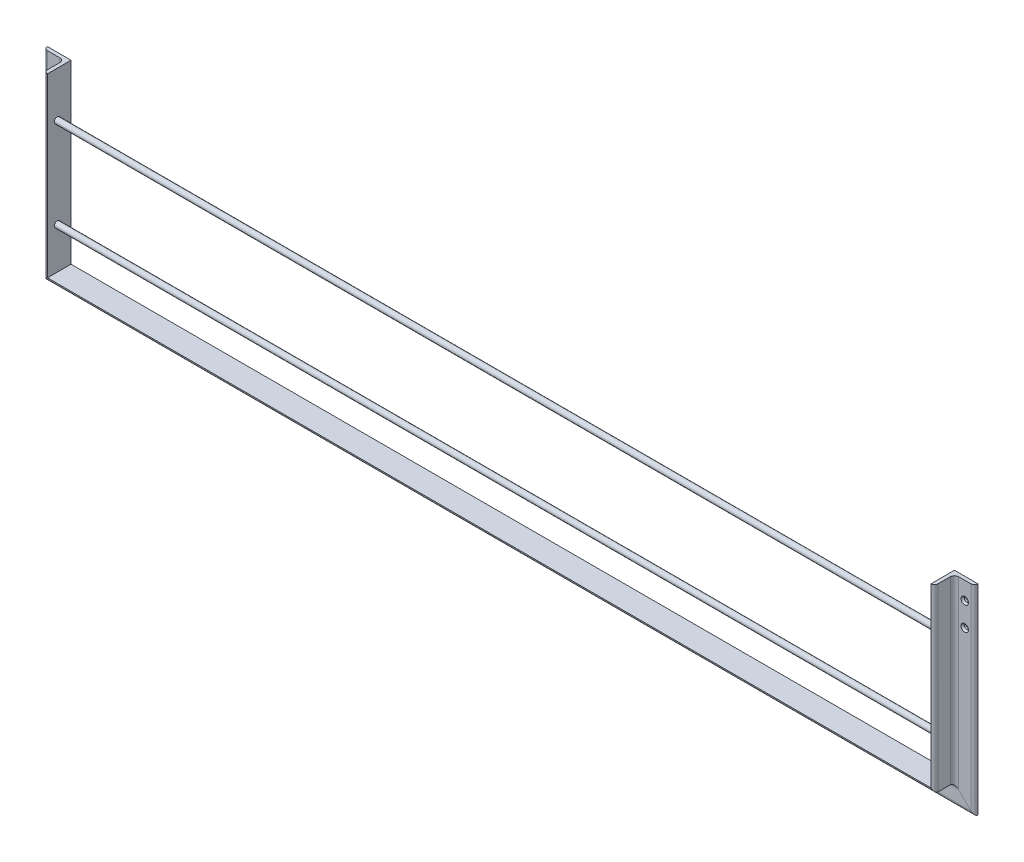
ISO-10303-21;
HEADER;
FILE_DESCRIPTION(('STEP AP214'),'2;1');
FILE_NAME('part.step','',(''),(''),'','','');
FILE_SCHEMA(('AUTOMOTIVE_DESIGN { 1 0 10303 214 1 1 1 1 }'));
ENDSEC;
DATA;
#1=APPLICATION_CONTEXT('core data for automotive mechanical design processes');
#2=APPLICATION_PROTOCOL_DEFINITION('international standard','automotive_design',2000,#1);
#3=PRODUCT_CONTEXT('',#1,'mechanical');
#4=PRODUCT('Part','Part','',(#3));
#5=PRODUCT_RELATED_PRODUCT_CATEGORY('part','',(#4));
#6=PRODUCT_DEFINITION_FORMATION('','',#4);
#7=PRODUCT_DEFINITION_CONTEXT('part definition',#1,'design');
#8=PRODUCT_DEFINITION('design','',#6,#7);
#9=PRODUCT_DEFINITION_SHAPE('','',#8);
#10=(LENGTH_UNIT() NAMED_UNIT(*) SI_UNIT(.MILLI.,.METRE.));
#11=(NAMED_UNIT(*) PLANE_ANGLE_UNIT() SI_UNIT($,.RADIAN.));
#12=(NAMED_UNIT(*) SI_UNIT($,.STERADIAN.) SOLID_ANGLE_UNIT());
#13=UNCERTAINTY_MEASURE_WITH_UNIT(LENGTH_MEASURE(1.E-05),#10,'distance_accuracy_value','');
#14=(GEOMETRIC_REPRESENTATION_CONTEXT(3) GLOBAL_UNCERTAINTY_ASSIGNED_CONTEXT((#13)) GLOBAL_UNIT_ASSIGNED_CONTEXT((#10,
#11,#12)) REPRESENTATION_CONTEXT('',''));
#15=CARTESIAN_POINT('',(0.,0.,0.));
#16=DIRECTION('',(0.,0.,1.));
#17=DIRECTION('',(1.,0.,0.));
#18=AXIS2_PLACEMENT_3D('',#15,#16,#17);
#19=CARTESIAN_POINT('',(750.,0.,0.));
#20=DIRECTION('',(1.,0.,0.));
#21=DIRECTION('',(0.,0.,-1.));
#22=AXIS2_PLACEMENT_3D('',#19,#20,#21);
#23=PLANE('',#22);
#24=CARTESIAN_POINT('',(750.,35.25,11.75));
#25=DIRECTION('',(1.,0.,0.));
#26=DIRECTION('',(0.,0.,-1.));
#27=AXIS2_PLACEMENT_3D('',#24,#25,#26);
#28=CIRCLE('',#27,2.5);
#29=CARTESIAN_POINT('',(750.,35.25,14.25));
#30=VERTEX_POINT('',#29);
#31=EDGE_CURVE('E11',#30,#30,#28,.T.);
#32=ORIENTED_EDGE('',*,*,#31,.T.);
#33=EDGE_LOOP('',(#32));
#34=FACE_BOUND('',#33,.T.);
#35=ADVANCED_FACE('F50',(#34),#23,.T.);
#36=CARTESIAN_POINT('',(0.,35.25,11.75));
#37=DIRECTION('',(1.,0.,0.));
#38=DIRECTION('',(0.,0.,-1.));
#39=AXIS2_PLACEMENT_3D('',#36,#37,#38);
#40=PLANE('',#39);
#41=CARTESIAN_POINT('',(0.,35.25,11.75));
#42=DIRECTION('',(1.,0.,0.));
#43=DIRECTION('',(0.,0.,-1.));
#44=AXIS2_PLACEMENT_3D('',#41,#42,#43);
#45=CIRCLE('',#44,2.5);
#46=CARTESIAN_POINT('',(0.,35.25,14.25));
#47=VERTEX_POINT('',#46);
#48=EDGE_CURVE('E57',#47,#47,#45,.T.);
#49=ORIENTED_EDGE('',*,*,#48,.F.);
#50=EDGE_LOOP('',(#49));
#51=FACE_BOUND('',#50,.T.);
#52=ADVANCED_FACE('F65',(#51),#40,.F.);
#53=CARTESIAN_POINT('',(500000.,35.25,11.75));
#54=DIRECTION('',(-1.,0.,0.));
#55=DIRECTION('',(0.,0.,1.));
#56=AXIS2_PLACEMENT_3D('',#53,#54,#55);
#57=CYLINDRICAL_SURFACE('',#56,2.5);
#58=CARTESIAN_POINT('',(0.,35.25,14.25));
#59=CARTESIAN_POINT('',(7.8125,35.25,14.25));
#60=CARTESIAN_POINT('',(15.625,35.25,14.25));
#61=CARTESIAN_POINT('',(31.25,35.25,14.25));
#62=CARTESIAN_POINT('',(39.0625,35.25,14.25));
#63=CARTESIAN_POINT('',(54.6875,35.25,14.25));
#64=CARTESIAN_POINT('',(62.5,35.25,14.25));
#65=CARTESIAN_POINT('',(78.125,35.25,14.25));
#66=CARTESIAN_POINT('',(85.9375,35.25,14.25));
#67=CARTESIAN_POINT('',(101.5625,35.25,14.25));
#68=CARTESIAN_POINT('',(109.375,35.25,14.25));
#69=CARTESIAN_POINT('',(125.,35.25,14.25));
#70=CARTESIAN_POINT('',(132.8125,35.25,14.25));
#71=CARTESIAN_POINT('',(148.4375,35.25,14.25));
#72=CARTESIAN_POINT('',(156.25,35.25,14.25));
#73=CARTESIAN_POINT('',(171.875,35.25,14.25));
#74=CARTESIAN_POINT('',(179.6875,35.25,14.25));
#75=CARTESIAN_POINT('',(195.3125,35.25,14.25));
#76=CARTESIAN_POINT('',(203.125,35.25,14.25));
#77=CARTESIAN_POINT('',(218.75,35.25,14.25));
#78=CARTESIAN_POINT('',(226.5625,35.25,14.25));
#79=CARTESIAN_POINT('',(242.1875,35.25,14.25));
#80=CARTESIAN_POINT('',(250.,35.25,14.25));
#81=CARTESIAN_POINT('',(265.625,35.25,14.25));
#82=CARTESIAN_POINT('',(273.4375,35.25,14.25));
#83=CARTESIAN_POINT('',(289.0625,35.25,14.25));
#84=CARTESIAN_POINT('',(296.875,35.25,14.25));
#85=CARTESIAN_POINT('',(312.5,35.25,14.25));
#86=CARTESIAN_POINT('',(320.3125,35.25,14.25));
#87=CARTESIAN_POINT('',(335.9375,35.25,14.25));
#88=CARTESIAN_POINT('',(343.75,35.25,14.25));
#89=CARTESIAN_POINT('',(359.375,35.25,14.25));
#90=CARTESIAN_POINT('',(367.1875,35.25,14.25));
#91=CARTESIAN_POINT('',(382.8125,35.25,14.25));
#92=CARTESIAN_POINT('',(390.625,35.25,14.25));
#93=CARTESIAN_POINT('',(406.25,35.25,14.25));
#94=CARTESIAN_POINT('',(414.0625,35.25,14.25));
#95=CARTESIAN_POINT('',(429.6875,35.25,14.25));
#96=CARTESIAN_POINT('',(437.5,35.25,14.25));
#97=CARTESIAN_POINT('',(453.125,35.25,14.25));
#98=CARTESIAN_POINT('',(460.9375,35.25,14.25));
#99=CARTESIAN_POINT('',(476.5625,35.25,14.25));
#100=CARTESIAN_POINT('',(484.375,35.25,14.25));
#101=CARTESIAN_POINT('',(500.,35.25,14.25));
#102=CARTESIAN_POINT('',(507.8125,35.25,14.25));
#103=CARTESIAN_POINT('',(523.4375,35.25,14.25));
#104=CARTESIAN_POINT('',(531.25,35.25,14.25));
#105=CARTESIAN_POINT('',(546.875,35.25,14.25));
#106=CARTESIAN_POINT('',(554.6875,35.25,14.25));
#107=CARTESIAN_POINT('',(570.3125,35.25,14.25));
#108=CARTESIAN_POINT('',(578.125,35.25,14.25));
#109=CARTESIAN_POINT('',(593.75,35.25,14.25));
#110=CARTESIAN_POINT('',(601.5625,35.25,14.25));
#111=CARTESIAN_POINT('',(617.1875,35.25,14.25));
#112=CARTESIAN_POINT('',(625.,35.25,14.25));
#113=CARTESIAN_POINT('',(640.625,35.25,14.25));
#114=CARTESIAN_POINT('',(648.4375,35.25,14.25));
#115=CARTESIAN_POINT('',(664.0625,35.25,14.25));
#116=CARTESIAN_POINT('',(671.875,35.25,14.25));
#117=CARTESIAN_POINT('',(687.5,35.25,14.25));
#118=CARTESIAN_POINT('',(695.3125,35.25,14.25));
#119=CARTESIAN_POINT('',(710.9375,35.25,14.25));
#120=CARTESIAN_POINT('',(718.75,35.25,14.25));
#121=CARTESIAN_POINT('',(734.375,35.25,14.25));
#122=CARTESIAN_POINT('',(742.1875,35.25,14.25));
#123=CARTESIAN_POINT('',(750.,35.25,14.25));
#124=B_SPLINE_CURVE_WITH_KNOTS('',3,(#58,#59,#60,#61,#62,#63,#64,#65,#66,#67,#68,#69,#70,#71,
#72,#73,#74,#75,#76,#77,#78,#79,#80,#81,#82,#83,#84,#85,#86,#87,#88,#89,#90,#91,#92,#93,#94,#95,
#96,#97,#98,#99,#100,#101,#102,#103,#104,#105,#106,#107,#108,#109,#110,#111,#112,#113,#114,#115,
#116,#117,#118,#119,#120,#121,#122,#123),.UNSPECIFIED.,.F.,.F.,(4,2,2,2,2,2,2,2,2,2,2,2,2,2,2,2,
2,2,2,2,2,2,2,2,2,2,2,2,2,2,2,2,4),(0.,23.4375,46.875,70.3125,93.75,117.1875,140.625,164.0625,
187.5,210.9375,234.375,257.8125,281.25,304.6875,328.125,351.5625,375.,398.4375,421.875,445.3125,
468.75,492.1875,515.625,539.0625,562.5,585.9375,609.375,632.8125,656.25,679.6875,703.125,
726.5625,750.),.UNSPECIFIED.);
#125=EDGE_CURVE('BSEAM52',#47,#30,#124,.T.);
#126=ORIENTED_EDGE('',*,*,#48,.T.);
#127=ORIENTED_EDGE('',*,*,#31,.F.);
#128=ORIENTED_EDGE('',*,*,#125,.T.);
#129=ORIENTED_EDGE('',*,*,#125,.F.);
#130=EDGE_LOOP('',(#126,#128,#127,#129));
#131=FACE_BOUND('',#130,.T.);
#132=ADVANCED_FACE('F52',(#131),#57,.T.);
#133=CLOSED_SHELL('',(#35,#52,#132));
#134=MANIFOLD_SOLID_BREP('B2',#133);
#135=CARTESIAN_POINT('',(750.,0.,0.));
#136=DIRECTION('',(1.,0.,0.));
#137=DIRECTION('',(0.,0.,-1.));
#138=AXIS2_PLACEMENT_3D('',#135,#136,#137);
#139=PLANE('',#138);
#140=CARTESIAN_POINT('',(750.,111.75,11.75));
#141=DIRECTION('',(1.,0.,0.));
#142=DIRECTION('',(0.,0.,-1.));
#143=AXIS2_PLACEMENT_3D('',#140,#141,#142);
#144=CIRCLE('',#143,2.5);
#145=CARTESIAN_POINT('',(750.,111.75,14.25));
#146=VERTEX_POINT('',#145);
#147=EDGE_CURVE('E49',#146,#146,#144,.T.);
#148=ORIENTED_EDGE('',*,*,#147,.T.);
#149=EDGE_LOOP('',(#148));
#150=FACE_BOUND('',#149,.T.);
#151=ADVANCED_FACE('F103',(#150),#139,.T.);
#152=CARTESIAN_POINT('',(0.,111.75,11.75));
#153=DIRECTION('',(1.,0.,0.));
#154=DIRECTION('',(0.,0.,-1.));
#155=AXIS2_PLACEMENT_3D('',#152,#153,#154);
#156=PLANE('',#155);
#157=CARTESIAN_POINT('',(0.,111.75,11.75));
#158=DIRECTION('',(1.,0.,0.));
#159=DIRECTION('',(0.,0.,-1.));
#160=AXIS2_PLACEMENT_3D('',#157,#158,#159);
#161=CIRCLE('',#160,2.5);
#162=CARTESIAN_POINT('',(0.,111.75,14.25));
#163=VERTEX_POINT('',#162);
#164=EDGE_CURVE('E110',#163,#163,#161,.T.);
#165=ORIENTED_EDGE('',*,*,#164,.F.);
#166=EDGE_LOOP('',(#165));
#167=FACE_BOUND('',#166,.T.);
#168=ADVANCED_FACE('F118',(#167),#156,.F.);
#169=CARTESIAN_POINT('',(500000.,111.75,11.75));
#170=DIRECTION('',(-1.,0.,0.));
#171=DIRECTION('',(0.,0.,1.));
#172=AXIS2_PLACEMENT_3D('',#169,#170,#171);
#173=CYLINDRICAL_SURFACE('',#172,2.5);
#174=CARTESIAN_POINT('',(0.,111.75,14.25));
#175=CARTESIAN_POINT('',(7.8125,111.75,14.25));
#176=CARTESIAN_POINT('',(15.625,111.75,14.25));
#177=CARTESIAN_POINT('',(31.25,111.75,14.25));
#178=CARTESIAN_POINT('',(39.0625,111.75,14.25));
#179=CARTESIAN_POINT('',(54.6875,111.75,14.25));
#180=CARTESIAN_POINT('',(62.5,111.75,14.25));
#181=CARTESIAN_POINT('',(78.125,111.75,14.25));
#182=CARTESIAN_POINT('',(85.9375,111.75,14.25));
#183=CARTESIAN_POINT('',(101.5625,111.75,14.25));
#184=CARTESIAN_POINT('',(109.375,111.75,14.25));
#185=CARTESIAN_POINT('',(125.,111.75,14.25));
#186=CARTESIAN_POINT('',(132.8125,111.75,14.25));
#187=CARTESIAN_POINT('',(148.4375,111.75,14.25));
#188=CARTESIAN_POINT('',(156.25,111.75,14.25));
#189=CARTESIAN_POINT('',(171.875,111.75,14.25));
#190=CARTESIAN_POINT('',(179.6875,111.75,14.25));
#191=CARTESIAN_POINT('',(195.3125,111.75,14.25));
#192=CARTESIAN_POINT('',(203.125,111.75,14.25));
#193=CARTESIAN_POINT('',(218.75,111.75,14.25));
#194=CARTESIAN_POINT('',(226.5625,111.75,14.25));
#195=CARTESIAN_POINT('',(242.1875,111.75,14.25));
#196=CARTESIAN_POINT('',(250.,111.75,14.25));
#197=CARTESIAN_POINT('',(265.625,111.75,14.25));
#198=CARTESIAN_POINT('',(273.4375,111.75,14.25));
#199=CARTESIAN_POINT('',(289.0625,111.75,14.25));
#200=CARTESIAN_POINT('',(296.875,111.75,14.25));
#201=CARTESIAN_POINT('',(312.5,111.75,14.25));
#202=CARTESIAN_POINT('',(320.3125,111.75,14.25));
#203=CARTESIAN_POINT('',(335.9375,111.75,14.25));
#204=CARTESIAN_POINT('',(343.75,111.75,14.25));
#205=CARTESIAN_POINT('',(359.375,111.75,14.25));
#206=CARTESIAN_POINT('',(367.1875,111.75,14.25));
#207=CARTESIAN_POINT('',(382.8125,111.75,14.25));
#208=CARTESIAN_POINT('',(390.625,111.75,14.25));
#209=CARTESIAN_POINT('',(406.25,111.75,14.25));
#210=CARTESIAN_POINT('',(414.0625,111.75,14.25));
#211=CARTESIAN_POINT('',(429.6875,111.75,14.25));
#212=CARTESIAN_POINT('',(437.5,111.75,14.25));
#213=CARTESIAN_POINT('',(453.125,111.75,14.25));
#214=CARTESIAN_POINT('',(460.9375,111.75,14.25));
#215=CARTESIAN_POINT('',(476.5625,111.75,14.25));
#216=CARTESIAN_POINT('',(484.375,111.75,14.25));
#217=CARTESIAN_POINT('',(500.,111.75,14.25));
#218=CARTESIAN_POINT('',(507.8125,111.75,14.25));
#219=CARTESIAN_POINT('',(523.4375,111.75,14.25));
#220=CARTESIAN_POINT('',(531.25,111.75,14.25));
#221=CARTESIAN_POINT('',(546.875,111.75,14.25));
#222=CARTESIAN_POINT('',(554.6875,111.75,14.25));
#223=CARTESIAN_POINT('',(570.3125,111.75,14.25));
#224=CARTESIAN_POINT('',(578.125,111.75,14.25));
#225=CARTESIAN_POINT('',(593.75,111.75,14.25));
#226=CARTESIAN_POINT('',(601.5625,111.75,14.25));
#227=CARTESIAN_POINT('',(617.1875,111.75,14.25));
#228=CARTESIAN_POINT('',(625.,111.75,14.25));
#229=CARTESIAN_POINT('',(640.625,111.75,14.25));
#230=CARTESIAN_POINT('',(648.4375,111.75,14.25));
#231=CARTESIAN_POINT('',(664.0625,111.75,14.25));
#232=CARTESIAN_POINT('',(671.875,111.75,14.25));
#233=CARTESIAN_POINT('',(687.5,111.75,14.25));
#234=CARTESIAN_POINT('',(695.3125,111.75,14.25));
#235=CARTESIAN_POINT('',(710.9375,111.75,14.25));
#236=CARTESIAN_POINT('',(718.75,111.75,14.25));
#237=CARTESIAN_POINT('',(734.375,111.75,14.25));
#238=CARTESIAN_POINT('',(742.1875,111.75,14.25));
#239=CARTESIAN_POINT('',(750.,111.75,14.25));
#240=B_SPLINE_CURVE_WITH_KNOTS('',3,(#174,#175,#176,#177,#178,#179,#180,#181,#182,#183,#184,
#185,#186,#187,#188,#189,#190,#191,#192,#193,#194,#195,#196,#197,#198,#199,#200,#201,#202,#203,
#204,#205,#206,#207,#208,#209,#210,#211,#212,#213,#214,#215,#216,#217,#218,#219,#220,#221,#222,
#223,#224,#225,#226,#227,#228,#229,#230,#231,#232,#233,#234,#235,#236,#237,#238,#239),
.UNSPECIFIED.,.F.,.F.,(4,2,2,2,2,2,2,2,2,2,2,2,2,2,2,2,2,2,2,2,2,2,2,2,2,2,2,2,2,2,2,2,4),(0.,
23.4375,46.875,70.3125,93.75,117.1875,140.625,164.0625,187.5,210.9375,234.375,257.8125,281.25,
304.6875,328.125,351.5625,375.,398.4375,421.875,445.3125,468.75,492.1875,515.625,539.0625,562.5,
585.9375,609.375,632.8125,656.25,679.6875,703.125,726.5625,750.),.UNSPECIFIED.);
#241=EDGE_CURVE('BSEAM105',#163,#146,#240,.T.);
#242=ORIENTED_EDGE('',*,*,#164,.T.);
#243=ORIENTED_EDGE('',*,*,#147,.F.);
#244=ORIENTED_EDGE('',*,*,#241,.T.);
#245=ORIENTED_EDGE('',*,*,#241,.F.);
#246=EDGE_LOOP('',(#242,#244,#243,#245));
#247=FACE_BOUND('',#246,.T.);
#248=ADVANCED_FACE('F105',(#247),#173,.T.);
#249=CLOSED_SHELL('',(#151,#168,#248));
#250=MANIFOLD_SOLID_BREP('B6',#249);
#251=CARTESIAN_POINT('',(770.,0.,0.));
#252=DIRECTION('',(0.,0.,1.));
#253=DIRECTION('',(1.,0.,0.));
#254=AXIS2_PLACEMENT_3D('',#251,#252,#253);
#255=PLANE('',#254);
#256=CARTESIAN_POINT('',(761.75,135.,0.));
#257=DIRECTION('',(0.,0.,1.));
#258=DIRECTION('',(1.,0.,0.));
#259=AXIS2_PLACEMENT_3D('',#256,#257,#258);
#260=CIRCLE('',#259,1.70000000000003);
#261=CARTESIAN_POINT('',(763.45,135.,0.));
#262=VERTEX_POINT('',#261);
#263=EDGE_CURVE('E286',#262,#262,#260,.T.);
#264=ORIENTED_EDGE('',*,*,#263,.T.);
#265=EDGE_LOOP('',(#264));
#266=FACE_BOUND('',#265,.T.);
#267=CARTESIAN_POINT('',(761.75,115.,0.));
#268=DIRECTION('',(0.,0.,1.));
#269=DIRECTION('',(1.,0.,0.));
#270=AXIS2_PLACEMENT_3D('',#267,#268,#269);
#271=CIRCLE('',#270,1.70000000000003);
#272=CARTESIAN_POINT('',(763.45,115.,0.));
#273=VERTEX_POINT('',#272);
#274=EDGE_CURVE('E275',#273,#273,#271,.T.);
#275=ORIENTED_EDGE('',*,*,#274,.T.);
#276=EDGE_LOOP('',(#275));
#277=FACE_BOUND('',#276,.T.);
#278=DIRECTION('',(0.707106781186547,-0.707106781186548,0.));
#279=VECTOR('',#278,1.);
#280=CARTESIAN_POINT('',(760.,-9.99999999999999,0.));
#281=LINE('',#280,#279);
#282=CARTESIAN_POINT('',(750.,0.,0.));
#283=VERTEX_POINT('',#282);
#284=CARTESIAN_POINT('',(770.,-20.,0.));
#285=VERTEX_POINT('',#284);
#286=EDGE_CURVE('E246',#283,#285,#281,.T.);
#287=ORIENTED_EDGE('',*,*,#286,.F.);
#288=DIRECTION('',(0.,1.,0.));
#289=VECTOR('',#288,1.);
#290=CARTESIAN_POINT('',(750.,0.,0.));
#291=LINE('',#290,#289);
#292=CARTESIAN_POINT('',(750.,150.,0.));
#293=VERTEX_POINT('',#292);
#294=EDGE_CURVE('E160',#283,#293,#291,.T.);
#295=ORIENTED_EDGE('',*,*,#294,.T.);
#296=DIRECTION('',(1.,0.,0.));
#297=VECTOR('',#296,1.);
#298=CARTESIAN_POINT('',(770.,150.,0.));
#299=LINE('',#298,#297);
#300=CARTESIAN_POINT('',(770.,150.,0.));
#301=VERTEX_POINT('',#300);
#302=EDGE_CURVE('E254',#293,#301,#299,.T.);
#303=ORIENTED_EDGE('',*,*,#302,.T.);
#304=DIRECTION('',(0.,1.,0.));
#305=VECTOR('',#304,1.);
#306=CARTESIAN_POINT('',(770.,0.,0.));
#307=LINE('',#306,#305);
#308=EDGE_CURVE('E207',#285,#301,#307,.T.);
#309=ORIENTED_EDGE('',*,*,#308,.F.);
#310=EDGE_LOOP('',(#287,#295,#303,#309));
#311=FACE_BOUND('',#310,.T.);
#312=ADVANCED_FACE('F156',(#266,#277,#311),#255,.F.);
#313=CARTESIAN_POINT('',(767.,0.,0.));
#314=DIRECTION('',(0.,1.,0.));
#315=DIRECTION('',(0.,0.,1.));
#316=AXIS2_PLACEMENT_3D('',#313,#314,#315);
#317=CYLINDRICAL_SURFACE('',#316,3.);
#318=CARTESIAN_POINT('',(767.,-17.,0.));
#319=DIRECTION('',(-0.707106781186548,-0.707106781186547,0.));
#320=DIRECTION('',(-0.707106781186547,0.707106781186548,0.));
#321=AXIS2_PLACEMENT_3D('',#318,#319,#320);
#322=ELLIPSE('',#321,4.24264068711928,3.);
#323=CARTESIAN_POINT('',(767.,-17.,3.));
#324=VERTEX_POINT('',#323);
#325=EDGE_CURVE('E214',#285,#324,#322,.T.);
#326=ORIENTED_EDGE('',*,*,#325,.F.);
#327=ORIENTED_EDGE('',*,*,#308,.T.);
#328=CARTESIAN_POINT('',(767.,150.,0.));
#329=DIRECTION('',(0.,-1.,0.));
#330=DIRECTION('',(0.,0.,1.));
#331=AXIS2_PLACEMENT_3D('',#328,#329,#330);
#332=CIRCLE('',#331,3.);
#333=CARTESIAN_POINT('',(767.,150.,3.));
#334=VERTEX_POINT('',#333);
#335=EDGE_CURVE('E253',#301,#334,#332,.T.);
#336=ORIENTED_EDGE('',*,*,#335,.T.);
#337=DIRECTION('',(0.,1.,0.));
#338=VECTOR('',#337,1.);
#339=CARTESIAN_POINT('',(767.,0.,3.));
#340=LINE('',#339,#338);
#341=EDGE_CURVE('E255',#324,#334,#340,.T.);
#342=ORIENTED_EDGE('',*,*,#341,.F.);
#343=EDGE_LOOP('',(#326,#327,#336,#342));
#344=FACE_BOUND('',#343,.T.);
#345=ADVANCED_FACE('F302',(#344),#317,.T.);
#346=CARTESIAN_POINT('',(756.5,0.,3.));
#347=DIRECTION('',(0.,0.,-1.));
#348=DIRECTION('',(-1.,0.,0.));
#349=AXIS2_PLACEMENT_3D('',#346,#347,#348);
#350=PLANE('',#349);
#351=CARTESIAN_POINT('',(761.75,135.,3.));
#352=DIRECTION('',(0.,0.,1.));
#353=DIRECTION('',(1.,0.,0.));
#354=AXIS2_PLACEMENT_3D('',#351,#352,#353);
#355=CIRCLE('',#354,3.14999999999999);
#356=CARTESIAN_POINT('',(764.9,135.,3.));
#357=VERTEX_POINT('',#356);
#358=EDGE_CURVE('E292',#357,#357,#355,.T.);
#359=ORIENTED_EDGE('',*,*,#358,.F.);
#360=EDGE_LOOP('',(#359));
#361=FACE_BOUND('',#360,.T.);
#362=CARTESIAN_POINT('',(761.75,115.,3.));
#363=DIRECTION('',(0.,0.,1.));
#364=DIRECTION('',(1.,0.,0.));
#365=AXIS2_PLACEMENT_3D('',#362,#363,#364);
#366=CIRCLE('',#365,3.14999999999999);
#367=CARTESIAN_POINT('',(764.9,115.,3.));
#368=VERTEX_POINT('',#367);
#369=EDGE_CURVE('E281',#368,#368,#366,.T.);
#370=ORIENTED_EDGE('',*,*,#369,.F.);
#371=EDGE_LOOP('',(#370));
#372=FACE_BOUND('',#371,.T.);
#373=DIRECTION('',(-0.707106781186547,0.707106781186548,0.));
#374=VECTOR('',#373,1.);
#375=CARTESIAN_POINT('',(753.25,-3.24999999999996,3.));
#376=LINE('',#375,#374);
#377=CARTESIAN_POINT('',(756.5,-6.49999999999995,3.));
#378=VERTEX_POINT('',#377);
#379=EDGE_CURVE('E240',#324,#378,#376,.T.);
#380=ORIENTED_EDGE('',*,*,#379,.F.);
#381=ORIENTED_EDGE('',*,*,#341,.T.);
#382=DIRECTION('',(-1.,0.,0.));
#383=VECTOR('',#382,1.);
#384=CARTESIAN_POINT('',(756.5,150.,3.));
#385=LINE('',#384,#383);
#386=CARTESIAN_POINT('',(756.5,150.,3.));
#387=VERTEX_POINT('',#386);
#388=EDGE_CURVE('E257',#334,#387,#385,.T.);
#389=ORIENTED_EDGE('',*,*,#388,.T.);
#390=DIRECTION('',(0.,1.,0.));
#391=VECTOR('',#390,1.);
#392=CARTESIAN_POINT('',(756.5,0.,3.));
#393=LINE('',#392,#391);
#394=EDGE_CURVE('E258',#378,#387,#393,.T.);
#395=ORIENTED_EDGE('',*,*,#394,.F.);
#396=EDGE_LOOP('',(#380,#381,#389,#395));
#397=FACE_BOUND('',#396,.T.);
#398=ADVANCED_FACE('F298',(#361,#372,#397),#350,.F.);
#399=CARTESIAN_POINT('',(756.5,0.,6.5));
#400=DIRECTION('',(0.,1.,0.));
#401=DIRECTION('',(0.,0.,1.));
#402=AXIS2_PLACEMENT_3D('',#399,#400,#401);
#403=CYLINDRICAL_SURFACE('',#402,3.5);
#404=CARTESIAN_POINT('',(756.5,-6.49999999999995,6.5));
#405=DIRECTION('',(-0.707106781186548,-0.707106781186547,0.));
#406=DIRECTION('',(-0.707106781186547,0.707106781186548,0.));
#407=AXIS2_PLACEMENT_3D('',#404,#405,#406);
#408=ELLIPSE('',#407,4.94974746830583,3.5);
#409=CARTESIAN_POINT('',(753.,-3.,6.5));
#410=VERTEX_POINT('',#409);
#411=EDGE_CURVE('E238',#378,#410,#408,.F.);
#412=ORIENTED_EDGE('',*,*,#411,.F.);
#413=ORIENTED_EDGE('',*,*,#394,.T.);
#414=CARTESIAN_POINT('',(756.5,150.,6.5));
#415=DIRECTION('',(0.,1.,0.));
#416=DIRECTION('',(0.,0.,-1.));
#417=AXIS2_PLACEMENT_3D('',#414,#415,#416);
#418=CIRCLE('',#417,3.5);
#419=CARTESIAN_POINT('',(753.,150.,6.5));
#420=VERTEX_POINT('',#419);
#421=EDGE_CURVE('E260',#387,#420,#418,.T.);
#422=ORIENTED_EDGE('',*,*,#421,.T.);
#423=DIRECTION('',(0.,1.,0.));
#424=VECTOR('',#423,1.);
#425=CARTESIAN_POINT('',(753.,0.,6.5));
#426=LINE('',#425,#424);
#427=EDGE_CURVE('E261',#410,#420,#426,.T.);
#428=ORIENTED_EDGE('',*,*,#427,.F.);
#429=EDGE_LOOP('',(#412,#413,#422,#428));
#430=FACE_BOUND('',#429,.T.);
#431=ADVANCED_FACE('F301',(#430),#403,.F.);
#432=CARTESIAN_POINT('',(753.,0.,17.));
#433=DIRECTION('',(-1.,0.,0.));
#434=DIRECTION('',(0.,0.,1.));
#435=AXIS2_PLACEMENT_3D('',#432,#433,#434);
#436=PLANE('',#435);
#437=DIRECTION('',(0.,0.,1.));
#438=VECTOR('',#437,1.);
#439=CARTESIAN_POINT('',(753.,-3.,17.));
#440=LINE('',#439,#438);
#441=CARTESIAN_POINT('',(753.,-3.,17.));
#442=VERTEX_POINT('',#441);
#443=EDGE_CURVE('E165',#410,#442,#440,.T.);
#444=ORIENTED_EDGE('',*,*,#443,.F.);
#445=ORIENTED_EDGE('',*,*,#427,.T.);
#446=DIRECTION('',(0.,0.,1.));
#447=VECTOR('',#446,1.);
#448=CARTESIAN_POINT('',(753.,150.,17.));
#449=LINE('',#448,#447);
#450=CARTESIAN_POINT('',(753.,150.,17.));
#451=VERTEX_POINT('',#450);
#452=EDGE_CURVE('E232',#420,#451,#449,.T.);
#453=ORIENTED_EDGE('',*,*,#452,.T.);
#454=DIRECTION('',(0.,1.,0.));
#455=VECTOR('',#454,1.);
#456=CARTESIAN_POINT('',(753.,0.,17.));
#457=LINE('',#456,#455);
#458=EDGE_CURVE('E223',#442,#451,#457,.T.);
#459=ORIENTED_EDGE('',*,*,#458,.F.);
#460=EDGE_LOOP('',(#444,#445,#453,#459));
#461=FACE_BOUND('',#460,.T.);
#462=ADVANCED_FACE('F229',(#461),#436,.F.);
#463=CARTESIAN_POINT('',(750.,0.,17.));
#464=DIRECTION('',(0.,1.,0.));
#465=DIRECTION('',(0.,0.,1.));
#466=AXIS2_PLACEMENT_3D('',#463,#464,#465);
#467=CYLINDRICAL_SURFACE('',#466,3.);
#468=CARTESIAN_POINT('',(750.,0.,17.));
#469=DIRECTION('',(-0.707106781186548,-0.707106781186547,0.));
#470=DIRECTION('',(-0.707106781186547,0.707106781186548,0.));
#471=AXIS2_PLACEMENT_3D('',#468,#469,#470);
#472=ELLIPSE('',#471,4.24264068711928,3.);
#473=CARTESIAN_POINT('',(750.,0.,20.));
#474=VERTEX_POINT('',#473);
#475=EDGE_CURVE('E101',#442,#474,#472,.T.);
#476=ORIENTED_EDGE('',*,*,#475,.F.);
#477=ORIENTED_EDGE('',*,*,#458,.T.);
#478=CARTESIAN_POINT('',(750.,150.,17.));
#479=DIRECTION('',(0.,-1.,0.));
#480=DIRECTION('',(0.,0.,-1.));
#481=AXIS2_PLACEMENT_3D('',#478,#479,#480);
#482=CIRCLE('',#481,3.);
#483=CARTESIAN_POINT('',(750.,150.,20.));
#484=VERTEX_POINT('',#483);
#485=EDGE_CURVE('E234',#451,#484,#482,.T.);
#486=ORIENTED_EDGE('',*,*,#485,.T.);
#487=DIRECTION('',(0.,1.,0.));
#488=VECTOR('',#487,1.);
#489=CARTESIAN_POINT('',(750.,0.,20.));
#490=LINE('',#489,#488);
#491=EDGE_CURVE('E178',#474,#484,#490,.T.);
#492=ORIENTED_EDGE('',*,*,#491,.F.);
#493=EDGE_LOOP('',(#476,#477,#486,#492));
#494=FACE_BOUND('',#493,.T.);
#495=ADVANCED_FACE('F222',(#494),#467,.T.);
#496=CARTESIAN_POINT('',(750.,0.,0.));
#497=DIRECTION('',(1.,0.,0.));
#498=DIRECTION('',(0.,0.,-1.));
#499=AXIS2_PLACEMENT_3D('',#496,#497,#498);
#500=PLANE('',#499);
#501=DIRECTION('',(0.,0.,-1.));
#502=VECTOR('',#501,1.);
#503=CARTESIAN_POINT('',(750.,0.,0.));
#504=LINE('',#503,#502);
#505=EDGE_CURVE('E249',#474,#283,#504,.T.);
#506=ORIENTED_EDGE('',*,*,#505,.F.);
#507=ORIENTED_EDGE('',*,*,#491,.T.);
#508=DIRECTION('',(0.,0.,-1.));
#509=VECTOR('',#508,1.);
#510=CARTESIAN_POINT('',(750.,150.,0.));
#511=LINE('',#510,#509);
#512=EDGE_CURVE('E251',#484,#293,#511,.T.);
#513=ORIENTED_EDGE('',*,*,#512,.T.);
#514=ORIENTED_EDGE('',*,*,#294,.F.);
#515=EDGE_LOOP('',(#506,#507,#513,#514));
#516=FACE_BOUND('',#515,.T.);
#517=ADVANCED_FACE('F322',(#516),#500,.F.);
#518=CARTESIAN_POINT('',(750.,150.,17.));
#519=DIRECTION('',(0.,1.,0.));
#520=DIRECTION('',(0.,0.,-1.));
#521=AXIS2_PLACEMENT_3D('',#518,#519,#520);
#522=PLANE('',#521);
#523=ORIENTED_EDGE('',*,*,#302,.F.);
#524=ORIENTED_EDGE('',*,*,#512,.F.);
#525=ORIENTED_EDGE('',*,*,#485,.F.);
#526=ORIENTED_EDGE('',*,*,#452,.F.);
#527=ORIENTED_EDGE('',*,*,#421,.F.);
#528=ORIENTED_EDGE('',*,*,#388,.F.);
#529=ORIENTED_EDGE('',*,*,#335,.F.);
#530=EDGE_LOOP('',(#523,#524,#525,#526,#527,#528,#529));
#531=FACE_BOUND('',#530,.T.);
#532=ADVANCED_FACE('F325',(#531),#522,.T.);
#533=CARTESIAN_POINT('',(750.,0.,0.));
#534=DIRECTION('',(-0.707106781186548,-0.707106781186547,0.));
#535=DIRECTION('',(0.707106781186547,-0.707106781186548,0.));
#536=AXIS2_PLACEMENT_3D('',#533,#534,#535);
#537=PLANE('',#536);
#538=ORIENTED_EDGE('',*,*,#505,.T.);
#539=ORIENTED_EDGE('',*,*,#286,.T.);
#540=ORIENTED_EDGE('',*,*,#325,.T.);
#541=ORIENTED_EDGE('',*,*,#379,.T.);
#542=ORIENTED_EDGE('',*,*,#411,.T.);
#543=ORIENTED_EDGE('',*,*,#443,.T.);
#544=ORIENTED_EDGE('',*,*,#475,.T.);
#545=EDGE_LOOP('',(#538,#539,#540,#541,#542,#543,#544));
#546=FACE_BOUND('',#545,.T.);
#547=ADVANCED_FACE('F158',(#546),#537,.T.);
#548=CARTESIAN_POINT('',(761.75,115.,3.));
#549=DIRECTION('',(0.,0.,1.));
#550=DIRECTION('',(1.,0.,0.));
#551=AXIS2_PLACEMENT_3D('',#548,#549,#550);
#552=CYLINDRICAL_SURFACE('',#551,1.70000000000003);
#553=ORIENTED_EDGE('',*,*,#274,.F.);
#554=EDGE_LOOP('',(#553));
#555=FACE_BOUND('',#554,.T.);
#556=CARTESIAN_POINT('',(761.75,115.,1.55));
#557=DIRECTION('',(0.,0.,1.));
#558=DIRECTION('',(1.,0.,0.));
#559=AXIS2_PLACEMENT_3D('',#556,#557,#558);
#560=CIRCLE('',#559,1.70000000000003);
#561=CARTESIAN_POINT('',(763.45,115.,1.55));
#562=VERTEX_POINT('',#561);
#563=EDGE_CURVE('E277',#562,#562,#560,.T.);
#564=ORIENTED_EDGE('',*,*,#563,.T.);
#565=EDGE_LOOP('',(#564));
#566=FACE_BOUND('',#565,.T.);
#567=ADVANCED_FACE('F329',(#555,#566),#552,.F.);
#568=CARTESIAN_POINT('',(761.75,115.,3.));
#569=DIRECTION('',(0.,0.,1.));
#570=DIRECTION('',(1.,0.,0.));
#571=AXIS2_PLACEMENT_3D('',#568,#569,#570);
#572=CONICAL_SURFACE('',#571,3.14999999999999,0.785398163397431);
#573=ORIENTED_EDGE('',*,*,#563,.F.);
#574=EDGE_LOOP('',(#573));
#575=FACE_BOUND('',#574,.T.);
#576=ORIENTED_EDGE('',*,*,#369,.T.);
#577=EDGE_LOOP('',(#576));
#578=FACE_BOUND('',#577,.T.);
#579=ADVANCED_FACE('F332',(#575,#578),#572,.F.);
#580=CARTESIAN_POINT('',(761.75,135.,3.));
#581=DIRECTION('',(0.,0.,1.));
#582=DIRECTION('',(1.,0.,0.));
#583=AXIS2_PLACEMENT_3D('',#580,#581,#582);
#584=CYLINDRICAL_SURFACE('',#583,1.70000000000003);
#585=ORIENTED_EDGE('',*,*,#263,.F.);
#586=EDGE_LOOP('',(#585));
#587=FACE_BOUND('',#586,.T.);
#588=CARTESIAN_POINT('',(761.75,135.,1.55));
#589=DIRECTION('',(0.,0.,1.));
#590=DIRECTION('',(1.,0.,0.));
#591=AXIS2_PLACEMENT_3D('',#588,#589,#590);
#592=CIRCLE('',#591,1.70000000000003);
#593=CARTESIAN_POINT('',(763.45,135.,1.55));
#594=VERTEX_POINT('',#593);
#595=EDGE_CURVE('E289',#594,#594,#592,.T.);
#596=ORIENTED_EDGE('',*,*,#595,.T.);
#597=EDGE_LOOP('',(#596));
#598=FACE_BOUND('',#597,.T.);
#599=ADVANCED_FACE('F336',(#587,#598),#584,.F.);
#600=CARTESIAN_POINT('',(761.75,135.,3.));
#601=DIRECTION('',(0.,0.,1.));
#602=DIRECTION('',(1.,0.,0.));
#603=AXIS2_PLACEMENT_3D('',#600,#601,#602);
#604=CONICAL_SURFACE('',#603,3.14999999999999,0.785398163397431);
#605=ORIENTED_EDGE('',*,*,#595,.F.);
#606=EDGE_LOOP('',(#605));
#607=FACE_BOUND('',#606,.T.);
#608=ORIENTED_EDGE('',*,*,#358,.T.);
#609=EDGE_LOOP('',(#608));
#610=FACE_BOUND('',#609,.T.);
#611=ADVANCED_FACE('F296',(#607,#610),#604,.F.);
#612=CLOSED_SHELL('',(#312,#345,#398,#431,#462,#495,#517,#532,#547,#567,#579,#599,#611));
#613=MANIFOLD_SOLID_BREP('B44',#612);
#614=CARTESIAN_POINT('',(0.,0.,0.));
#615=DIRECTION('',(-0.707106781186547,0.707106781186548,0.));
#616=DIRECTION('',(-0.707106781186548,-0.707106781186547,0.));
#617=AXIS2_PLACEMENT_3D('',#614,#615,#616);
#618=PLANE('',#617);
#619=DIRECTION('',(0.,0.,-1.));
#620=VECTOR('',#619,1.);
#621=CARTESIAN_POINT('',(0.,0.,0.));
#622=LINE('',#621,#620);
#623=CARTESIAN_POINT('',(0.,0.,20.));
#624=VERTEX_POINT('',#623);
#625=CARTESIAN_POINT('',(0.,0.,0.));
#626=VERTEX_POINT('',#625);
#627=EDGE_CURVE('E546',#624,#626,#622,.T.);
#628=ORIENTED_EDGE('',*,*,#627,.T.);
#629=DIRECTION('',(-0.707106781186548,-0.707106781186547,0.));
#630=VECTOR('',#629,1.);
#631=CARTESIAN_POINT('',(-10.,-9.99999999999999,0.));
#632=LINE('',#631,#630);
#633=CARTESIAN_POINT('',(-20.,-20.,0.));
#634=VERTEX_POINT('',#633);
#635=EDGE_CURVE('E543',#626,#634,#632,.T.);
#636=ORIENTED_EDGE('',*,*,#635,.T.);
#637=CARTESIAN_POINT('',(-17.,-17.,0.));
#638=DIRECTION('',(-0.707106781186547,0.707106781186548,0.));
#639=DIRECTION('',(0.707106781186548,0.707106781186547,0.));
#640=AXIS2_PLACEMENT_3D('',#637,#638,#639);
#641=ELLIPSE('',#640,4.24264068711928,3.);
#642=CARTESIAN_POINT('',(-17.,-17.,3.));
#643=VERTEX_POINT('',#642);
#644=EDGE_CURVE('E540',#634,#643,#641,.T.);
#645=ORIENTED_EDGE('',*,*,#644,.T.);
#646=DIRECTION('',(0.707106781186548,0.707106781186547,0.));
#647=VECTOR('',#646,1.);
#648=CARTESIAN_POINT('',(-3.24999999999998,-3.25,3.));
#649=LINE('',#648,#647);
#650=CARTESIAN_POINT('',(-6.50000000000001,-6.50000000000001,3.));
#651=VERTEX_POINT('',#650);
#652=EDGE_CURVE('E538',#643,#651,#649,.T.);
#653=ORIENTED_EDGE('',*,*,#652,.T.);
#654=CARTESIAN_POINT('',(-6.50000000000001,-6.50000000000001,6.5));
#655=DIRECTION('',(-0.707106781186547,0.707106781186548,0.));
#656=DIRECTION('',(0.707106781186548,0.707106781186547,0.));
#657=AXIS2_PLACEMENT_3D('',#654,#655,#656);
#658=ELLIPSE('',#657,4.94974746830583,3.5);
#659=CARTESIAN_POINT('',(-3.,-3.,6.5));
#660=VERTEX_POINT('',#659);
#661=EDGE_CURVE('E517',#651,#660,#658,.F.);
#662=ORIENTED_EDGE('',*,*,#661,.T.);
#663=DIRECTION('',(0.,0.,1.));
#664=VECTOR('',#663,1.);
#665=CARTESIAN_POINT('',(-3.,-3.,17.));
#666=LINE('',#665,#664);
#667=CARTESIAN_POINT('',(-3.,-3.,17.));
#668=VERTEX_POINT('',#667);
#669=EDGE_CURVE('E534',#660,#668,#666,.T.);
#670=ORIENTED_EDGE('',*,*,#669,.T.);
#671=CARTESIAN_POINT('',(0.,0.,17.));
#672=DIRECTION('',(-0.707106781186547,0.707106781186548,0.));
#673=DIRECTION('',(0.707106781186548,0.707106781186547,0.));
#674=AXIS2_PLACEMENT_3D('',#671,#672,#673);
#675=ELLIPSE('',#674,4.24264068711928,3.);
#676=EDGE_CURVE('E531',#668,#624,#675,.T.);
#677=ORIENTED_EDGE('',*,*,#676,.T.);
#678=EDGE_LOOP('',(#628,#636,#645,#653,#662,#670,#677));
#679=FACE_BOUND('',#678,.T.);
#680=ADVANCED_FACE('F457',(#679),#618,.T.);
#681=CARTESIAN_POINT('',(0.,0.,0.));
#682=DIRECTION('',(0.,-1.,0.));
#683=DIRECTION('',(0.,0.,-1.));
#684=AXIS2_PLACEMENT_3D('',#681,#682,#683);
#685=PLANE('',#684);
#686=DIRECTION('',(1.,0.,0.));
#687=VECTOR('',#686,1.);
#688=CARTESIAN_POINT('',(0.,0.,20.));
#689=LINE('',#688,#687);
#690=CARTESIAN_POINT('',(750.,0.,20.));
#691=VERTEX_POINT('',#690);
#692=EDGE_CURVE('E549',#624,#691,#689,.T.);
#693=ORIENTED_EDGE('',*,*,#692,.T.);
#694=DIRECTION('',(0.,0.,-1.));
#695=VECTOR('',#694,1.);
#696=CARTESIAN_POINT('',(750.,0.,0.));
#697=LINE('',#696,#695);
#698=CARTESIAN_POINT('',(750.,0.,0.));
#699=VERTEX_POINT('',#698);
#700=EDGE_CURVE('E460',#691,#699,#697,.T.);
#701=ORIENTED_EDGE('',*,*,#700,.T.);
#702=DIRECTION('',(1.,0.,0.));
#703=VECTOR('',#702,1.);
#704=CARTESIAN_POINT('',(0.,0.,0.));
#705=LINE('',#704,#703);
#706=EDGE_CURVE('E552',#626,#699,#705,.T.);
#707=ORIENTED_EDGE('',*,*,#706,.F.);
#708=ORIENTED_EDGE('',*,*,#627,.F.);
#709=EDGE_LOOP('',(#693,#701,#707,#708));
#710=FACE_BOUND('',#709,.T.);
#711=ADVANCED_FACE('F598',(#710),#685,.F.);
#712=CARTESIAN_POINT('',(0.,0.,17.));
#713=DIRECTION('',(1.,0.,0.));
#714=DIRECTION('',(0.,0.,-1.));
#715=AXIS2_PLACEMENT_3D('',#712,#713,#714);
#716=CYLINDRICAL_SURFACE('',#715,3.);
#717=DIRECTION('',(1.,0.,0.));
#718=VECTOR('',#717,1.);
#719=CARTESIAN_POINT('',(0.,-3.,17.));
#720=LINE('',#719,#718);
#721=CARTESIAN_POINT('',(753.,-3.,17.));
#722=VERTEX_POINT('',#721);
#723=EDGE_CURVE('E555',#668,#722,#720,.T.);
#724=ORIENTED_EDGE('',*,*,#723,.T.);
#725=CARTESIAN_POINT('',(750.,0.,17.));
#726=DIRECTION('',(-0.707106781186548,-0.707106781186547,0.));
#727=DIRECTION('',(0.707106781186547,-0.707106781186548,0.));
#728=AXIS2_PLACEMENT_3D('',#725,#726,#727);
#729=ELLIPSE('',#728,4.24264068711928,3.);
#730=EDGE_CURVE('E154',#722,#691,#729,.T.);
#731=ORIENTED_EDGE('',*,*,#730,.T.);
#732=ORIENTED_EDGE('',*,*,#692,.F.);
#733=ORIENTED_EDGE('',*,*,#676,.F.);
#734=EDGE_LOOP('',(#724,#731,#732,#733));
#735=FACE_BOUND('',#734,.T.);
#736=ADVANCED_FACE('F602',(#735),#716,.T.);
#737=CARTESIAN_POINT('',(0.,-3.,17.));
#738=DIRECTION('',(0.,1.,0.));
#739=DIRECTION('',(0.,0.,1.));
#740=AXIS2_PLACEMENT_3D('',#737,#738,#739);
#741=PLANE('',#740);
#742=DIRECTION('',(1.,0.,0.));
#743=VECTOR('',#742,1.);
#744=CARTESIAN_POINT('',(0.,-3.,6.5));
#745=LINE('',#744,#743);
#746=CARTESIAN_POINT('',(753.,-3.,6.5));
#747=VERTEX_POINT('',#746);
#748=EDGE_CURVE('E521',#660,#747,#745,.T.);
#749=ORIENTED_EDGE('',*,*,#748,.T.);
#750=DIRECTION('',(0.,0.,1.));
#751=VECTOR('',#750,1.);
#752=CARTESIAN_POINT('',(753.,-3.,17.0000000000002));
#753=LINE('',#752,#751);
#754=EDGE_CURVE('E465',#747,#722,#753,.T.);
#755=ORIENTED_EDGE('',*,*,#754,.T.);
#756=ORIENTED_EDGE('',*,*,#723,.F.);
#757=ORIENTED_EDGE('',*,*,#669,.F.);
#758=EDGE_LOOP('',(#749,#755,#756,#757));
#759=FACE_BOUND('',#758,.T.);
#760=ADVANCED_FACE('F572',(#759),#741,.F.);
#761=CARTESIAN_POINT('',(0.,-6.50000000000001,6.5));
#762=DIRECTION('',(1.,0.,0.));
#763=DIRECTION('',(0.,0.,-1.));
#764=AXIS2_PLACEMENT_3D('',#761,#762,#763);
#765=CYLINDRICAL_SURFACE('',#764,3.5);
#766=DIRECTION('',(1.,0.,0.));
#767=VECTOR('',#766,1.);
#768=CARTESIAN_POINT('',(0.,-6.50000000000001,3.));
#769=LINE('',#768,#767);
#770=CARTESIAN_POINT('',(756.5,-6.50000000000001,3.));
#771=VERTEX_POINT('',#770);
#772=EDGE_CURVE('E513',#651,#771,#769,.T.);
#773=ORIENTED_EDGE('',*,*,#772,.T.);
#774=CARTESIAN_POINT('',(756.5,-6.50000000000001,6.5));
#775=DIRECTION('',(-0.707106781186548,-0.707106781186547,0.));
#776=DIRECTION('',(0.707106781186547,-0.707106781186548,0.));
#777=AXIS2_PLACEMENT_3D('',#774,#775,#776);
#778=ELLIPSE('',#777,4.94974746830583,3.5);
#779=EDGE_CURVE('E500',#771,#747,#778,.F.);
#780=ORIENTED_EDGE('',*,*,#779,.T.);
#781=ORIENTED_EDGE('',*,*,#748,.F.);
#782=ORIENTED_EDGE('',*,*,#661,.F.);
#783=EDGE_LOOP('',(#773,#780,#781,#782));
#784=FACE_BOUND('',#783,.T.);
#785=ADVANCED_FACE('F514',(#784),#765,.F.);
#786=CARTESIAN_POINT('',(0.,-6.50000000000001,3.));
#787=DIRECTION('',(0.,0.,-1.));
#788=DIRECTION('',(-1.,0.,0.));
#789=AXIS2_PLACEMENT_3D('',#786,#787,#788);
#790=PLANE('',#789);
#791=CARTESIAN_POINT('',(568.375,-11.7499999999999,3.));
#792=DIRECTION('',(0.,0.,1.));
#793=DIRECTION('',(1.,0.,0.));
#794=AXIS2_PLACEMENT_3D('',#791,#792,#793);
#795=CIRCLE('',#794,3.14999999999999);
#796=CARTESIAN_POINT('',(571.525,-11.7499999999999,3.));
#797=VERTEX_POINT('',#796);
#798=EDGE_CURVE('E623',#797,#797,#795,.T.);
#799=ORIENTED_EDGE('',*,*,#798,.F.);
#800=EDGE_LOOP('',(#799));
#801=FACE_BOUND('',#800,.T.);
#802=CARTESIAN_POINT('',(181.625,-11.7499999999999,3.));
#803=DIRECTION('',(0.,0.,1.));
#804=DIRECTION('',(1.,0.,0.));
#805=AXIS2_PLACEMENT_3D('',#802,#803,#804);
#806=CIRCLE('',#805,3.14999999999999);
#807=CARTESIAN_POINT('',(184.775,-11.7499999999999,3.));
#808=VERTEX_POINT('',#807);
#809=EDGE_CURVE('E567',#808,#808,#806,.T.);
#810=ORIENTED_EDGE('',*,*,#809,.F.);
#811=EDGE_LOOP('',(#810));
#812=FACE_BOUND('',#811,.T.);
#813=DIRECTION('',(1.,0.,0.));
#814=VECTOR('',#813,1.);
#815=CARTESIAN_POINT('',(0.,-17.,3.));
#816=LINE('',#815,#814);
#817=CARTESIAN_POINT('',(767.,-17.,3.));
#818=VERTEX_POINT('',#817);
#819=EDGE_CURVE('E522',#643,#818,#816,.T.);
#820=ORIENTED_EDGE('',*,*,#819,.T.);
#821=DIRECTION('',(-0.707106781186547,0.707106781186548,0.));
#822=VECTOR('',#821,1.);
#823=CARTESIAN_POINT('',(378.25,371.75,3.));
#824=LINE('',#823,#822);
#825=EDGE_CURVE('E504',#818,#771,#824,.T.);
#826=ORIENTED_EDGE('',*,*,#825,.T.);
#827=ORIENTED_EDGE('',*,*,#772,.F.);
#828=ORIENTED_EDGE('',*,*,#652,.F.);
#829=EDGE_LOOP('',(#820,#826,#827,#828));
#830=FACE_BOUND('',#829,.T.);
#831=ADVANCED_FACE('F524',(#801,#812,#830),#790,.F.);
#832=CARTESIAN_POINT('',(0.,-17.,0.));
#833=DIRECTION('',(1.,0.,0.));
#834=DIRECTION('',(0.,0.,-1.));
#835=AXIS2_PLACEMENT_3D('',#832,#833,#834);
#836=CYLINDRICAL_SURFACE('',#835,3.);
#837=DIRECTION('',(1.,0.,0.));
#838=VECTOR('',#837,1.);
#839=CARTESIAN_POINT('',(0.,-20.,0.));
#840=LINE('',#839,#838);
#841=CARTESIAN_POINT('',(770.,-20.,0.));
#842=VERTEX_POINT('',#841);
#843=EDGE_CURVE('E550',#634,#842,#840,.T.);
#844=ORIENTED_EDGE('',*,*,#843,.T.);
#845=CARTESIAN_POINT('',(767.,-17.,0.));
#846=DIRECTION('',(-0.707106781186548,-0.707106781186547,0.));
#847=DIRECTION('',(0.707106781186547,-0.707106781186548,0.));
#848=AXIS2_PLACEMENT_3D('',#845,#846,#847);
#849=ELLIPSE('',#848,4.24264068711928,3.);
#850=EDGE_CURVE('E486',#842,#818,#849,.T.);
#851=ORIENTED_EDGE('',*,*,#850,.T.);
#852=ORIENTED_EDGE('',*,*,#819,.F.);
#853=ORIENTED_EDGE('',*,*,#644,.F.);
#854=EDGE_LOOP('',(#844,#851,#852,#853));
#855=FACE_BOUND('',#854,.T.);
#856=ADVANCED_FACE('F584',(#855),#836,.T.);
#857=CARTESIAN_POINT('',(0.,-20.,0.));
#858=DIRECTION('',(0.,0.,1.));
#859=DIRECTION('',(1.,0.,0.));
#860=AXIS2_PLACEMENT_3D('',#857,#858,#859);
#861=PLANE('',#860);
#862=CARTESIAN_POINT('',(568.375,-11.7499999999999,0.));
#863=DIRECTION('',(0.,0.,1.));
#864=DIRECTION('',(1.,0.,0.));
#865=AXIS2_PLACEMENT_3D('',#862,#863,#864);
#866=CIRCLE('',#865,1.70000000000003);
#867=CARTESIAN_POINT('',(570.075,-11.7499999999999,0.));
#868=VERTEX_POINT('',#867);
#869=EDGE_CURVE('E627',#868,#868,#866,.T.);
#870=ORIENTED_EDGE('',*,*,#869,.T.);
#871=EDGE_LOOP('',(#870));
#872=FACE_BOUND('',#871,.T.);
#873=CARTESIAN_POINT('',(181.625,-11.7499999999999,0.));
#874=DIRECTION('',(0.,0.,1.));
#875=DIRECTION('',(1.,0.,0.));
#876=AXIS2_PLACEMENT_3D('',#873,#874,#875);
#877=CIRCLE('',#876,1.70000000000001);
#878=CARTESIAN_POINT('',(183.325,-11.7499999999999,0.));
#879=VERTEX_POINT('',#878);
#880=EDGE_CURVE('E558',#879,#879,#877,.T.);
#881=ORIENTED_EDGE('',*,*,#880,.T.);
#882=EDGE_LOOP('',(#881));
#883=FACE_BOUND('',#882,.T.);
#884=ORIENTED_EDGE('',*,*,#706,.T.);
#885=DIRECTION('',(0.707106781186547,-0.707106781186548,0.));
#886=VECTOR('',#885,1.);
#887=CARTESIAN_POINT('',(385.,365.,0.));
#888=LINE('',#887,#886);
#889=EDGE_CURVE('E492',#699,#842,#888,.T.);
#890=ORIENTED_EDGE('',*,*,#889,.T.);
#891=ORIENTED_EDGE('',*,*,#843,.F.);
#892=ORIENTED_EDGE('',*,*,#635,.F.);
#893=EDGE_LOOP('',(#884,#890,#891,#892));
#894=FACE_BOUND('',#893,.T.);
#895=ADVANCED_FACE('F586',(#872,#883,#894),#861,.F.);
#896=CARTESIAN_POINT('',(750.,0.,0.));
#897=DIRECTION('',(-0.707106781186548,-0.707106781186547,0.));
#898=DIRECTION('',(0.707106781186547,-0.707106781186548,0.));
#899=AXIS2_PLACEMENT_3D('',#896,#897,#898);
#900=PLANE('',#899);
#901=ORIENTED_EDGE('',*,*,#700,.F.);
#902=ORIENTED_EDGE('',*,*,#730,.F.);
#903=ORIENTED_EDGE('',*,*,#754,.F.);
#904=ORIENTED_EDGE('',*,*,#779,.F.);
#905=ORIENTED_EDGE('',*,*,#825,.F.);
#906=ORIENTED_EDGE('',*,*,#850,.F.);
#907=ORIENTED_EDGE('',*,*,#889,.F.);
#908=EDGE_LOOP('',(#901,#902,#903,#904,#905,#906,#907));
#909=FACE_BOUND('',#908,.T.);
#910=ADVANCED_FACE('F502',(#909),#900,.F.);
#911=CARTESIAN_POINT('',(181.625,-11.7499999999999,3.));
#912=DIRECTION('',(0.,0.,1.));
#913=DIRECTION('',(1.,0.,0.));
#914=AXIS2_PLACEMENT_3D('',#911,#912,#913);
#915=CYLINDRICAL_SURFACE('',#914,1.70000000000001);
#916=ORIENTED_EDGE('',*,*,#880,.F.);
#917=EDGE_LOOP('',(#916));
#918=FACE_BOUND('',#917,.T.);
#919=CARTESIAN_POINT('',(181.625,-11.7499999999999,1.55));
#920=DIRECTION('',(0.,0.,1.));
#921=DIRECTION('',(1.,0.,0.));
#922=AXIS2_PLACEMENT_3D('',#919,#920,#921);
#923=CIRCLE('',#922,1.70000000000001);
#924=CARTESIAN_POINT('',(183.325,-11.7499999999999,1.55));
#925=VERTEX_POINT('',#924);
#926=EDGE_CURVE('E562',#925,#925,#923,.T.);
#927=ORIENTED_EDGE('',*,*,#926,.T.);
#928=EDGE_LOOP('',(#927));
#929=FACE_BOUND('',#928,.T.);
#930=ADVANCED_FACE('F593',(#918,#929),#915,.F.);
#931=CARTESIAN_POINT('',(181.625,-11.7499999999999,3.));
#932=DIRECTION('',(0.,0.,1.));
#933=DIRECTION('',(1.,0.,0.));
#934=AXIS2_PLACEMENT_3D('',#931,#932,#933);
#935=CONICAL_SURFACE('',#934,3.14999999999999,0.785398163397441);
#936=ORIENTED_EDGE('',*,*,#926,.F.);
#937=EDGE_LOOP('',(#936));
#938=FACE_BOUND('',#937,.T.);
#939=ORIENTED_EDGE('',*,*,#809,.T.);
#940=EDGE_LOOP('',(#939));
#941=FACE_BOUND('',#940,.T.);
#942=ADVANCED_FACE('F642',(#938,#941),#935,.F.);
#943=CARTESIAN_POINT('',(568.375,-11.7499999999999,3.));
#944=DIRECTION('',(0.,0.,1.));
#945=DIRECTION('',(1.,0.,0.));
#946=AXIS2_PLACEMENT_3D('',#943,#944,#945);
#947=CYLINDRICAL_SURFACE('',#946,1.70000000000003);
#948=ORIENTED_EDGE('',*,*,#869,.F.);
#949=EDGE_LOOP('',(#948));
#950=FACE_BOUND('',#949,.T.);
#951=CARTESIAN_POINT('',(568.375,-11.7499999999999,1.55));
#952=DIRECTION('',(0.,0.,1.));
#953=DIRECTION('',(1.,0.,0.));
#954=AXIS2_PLACEMENT_3D('',#951,#952,#953);
#955=CIRCLE('',#954,1.70000000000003);
#956=CARTESIAN_POINT('',(570.075,-11.7499999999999,1.55));
#957=VERTEX_POINT('',#956);
#958=EDGE_CURVE('E628',#957,#957,#955,.T.);
#959=ORIENTED_EDGE('',*,*,#958,.T.);
#960=EDGE_LOOP('',(#959));
#961=FACE_BOUND('',#960,.T.);
#962=ADVANCED_FACE('F636',(#950,#961),#947,.F.);
#963=CARTESIAN_POINT('',(568.375,-11.7499999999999,3.));
#964=DIRECTION('',(0.,0.,1.));
#965=DIRECTION('',(1.,0.,0.));
#966=AXIS2_PLACEMENT_3D('',#963,#964,#965);
#967=CONICAL_SURFACE('',#966,3.14999999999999,0.785398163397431);
#968=ORIENTED_EDGE('',*,*,#958,.F.);
#969=EDGE_LOOP('',(#968));
#970=FACE_BOUND('',#969,.T.);
#971=ORIENTED_EDGE('',*,*,#798,.T.);
#972=EDGE_LOOP('',(#971));
#973=FACE_BOUND('',#972,.T.);
#974=ADVANCED_FACE('F634',(#970,#973),#967,.F.);
#975=CLOSED_SHELL('',(#680,#711,#736,#760,#785,#831,#856,#895,#910,#930,#942,#962,#974));
#976=MANIFOLD_SOLID_BREP('B95',#975);
#977=CARTESIAN_POINT('',(0.,150.,17.));
#978=DIRECTION('',(0.,-1.,0.));
#979=DIRECTION('',(0.,0.,-1.));
#980=AXIS2_PLACEMENT_3D('',#977,#978,#979);
#981=PLANE('',#980);
#982=DIRECTION('',(-1.,0.,0.));
#983=VECTOR('',#982,1.);
#984=CARTESIAN_POINT('',(-20.,150.,0.));
#985=LINE('',#984,#983);
#986=CARTESIAN_POINT('',(0.,150.,0.));
#987=VERTEX_POINT('',#986);
#988=CARTESIAN_POINT('',(-20.,150.,0.));
#989=VERTEX_POINT('',#988);
#990=EDGE_CURVE('E823',#987,#989,#985,.T.);
#991=ORIENTED_EDGE('',*,*,#990,.T.);
#992=CARTESIAN_POINT('',(-17.,150.,0.));
#993=DIRECTION('',(0.,1.,0.));
#994=DIRECTION('',(0.,0.,1.));
#995=AXIS2_PLACEMENT_3D('',#992,#993,#994);
#996=CIRCLE('',#995,3.);
#997=CARTESIAN_POINT('',(-17.,150.,3.));
#998=VERTEX_POINT('',#997);
#999=EDGE_CURVE('E826',#989,#998,#996,.T.);
#1000=ORIENTED_EDGE('',*,*,#999,.T.);
#1001=DIRECTION('',(1.,0.,0.));
#1002=VECTOR('',#1001,1.);
#1003=CARTESIAN_POINT('',(-6.50000000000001,150.,3.));
#1004=LINE('',#1003,#1002);
#1005=CARTESIAN_POINT('',(-6.50000000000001,150.,3.));
#1006=VERTEX_POINT('',#1005);
#1007=EDGE_CURVE('E830',#998,#1006,#1004,.T.);
#1008=ORIENTED_EDGE('',*,*,#1007,.T.);
#1009=CARTESIAN_POINT('',(-6.50000000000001,150.,6.5));
#1010=DIRECTION('',(0.,-1.,0.));
#1011=DIRECTION('',(0.,0.,-1.));
#1012=AXIS2_PLACEMENT_3D('',#1009,#1010,#1011);
#1013=CIRCLE('',#1012,3.5);
#1014=CARTESIAN_POINT('',(-3.,150.,6.5));
#1015=VERTEX_POINT('',#1014);
#1016=EDGE_CURVE('E810',#1006,#1015,#1013,.T.);
#1017=ORIENTED_EDGE('',*,*,#1016,.T.);
#1018=DIRECTION('',(0.,0.,1.));
#1019=VECTOR('',#1018,1.);
#1020=CARTESIAN_POINT('',(-3.,150.,17.));
#1021=LINE('',#1020,#1019);
#1022=CARTESIAN_POINT('',(-3.,150.,17.));
#1023=VERTEX_POINT('',#1022);
#1024=EDGE_CURVE('E834',#1015,#1023,#1021,.T.);
#1025=ORIENTED_EDGE('',*,*,#1024,.T.);
#1026=CARTESIAN_POINT('',(0.,150.,17.));
#1027=DIRECTION('',(0.,1.,0.));
#1028=DIRECTION('',(0.,0.,-1.));
#1029=AXIS2_PLACEMENT_3D('',#1026,#1027,#1028);
#1030=CIRCLE('',#1029,3.);
#1031=CARTESIAN_POINT('',(0.,150.,20.));
#1032=VERTEX_POINT('',#1031);
#1033=EDGE_CURVE('E837',#1023,#1032,#1030,.T.);
#1034=ORIENTED_EDGE('',*,*,#1033,.T.);
#1035=DIRECTION('',(0.,0.,-1.));
#1036=VECTOR('',#1035,1.);
#1037=CARTESIAN_POINT('',(0.,150.,0.));
#1038=LINE('',#1037,#1036);
#1039=EDGE_CURVE('E840',#1032,#987,#1038,.T.);
#1040=ORIENTED_EDGE('',*,*,#1039,.T.);
#1041=EDGE_LOOP('',(#991,#1000,#1008,#1017,#1025,#1034,#1040));
#1042=FACE_BOUND('',#1041,.T.);
#1043=ADVANCED_FACE('F749',(#1042),#981,.F.);
#1044=CARTESIAN_POINT('',(0.,150.,0.));
#1045=DIRECTION('',(-1.,0.,0.));
#1046=DIRECTION('',(0.,0.,1.));
#1047=AXIS2_PLACEMENT_3D('',#1044,#1045,#1046);
#1048=PLANE('',#1047);
#1049=DIRECTION('',(0.,-1.,0.));
#1050=VECTOR('',#1049,1.);
#1051=CARTESIAN_POINT('',(0.,150.,20.));
#1052=LINE('',#1051,#1050);
#1053=CARTESIAN_POINT('',(0.,0.,20.));
#1054=VERTEX_POINT('',#1053);
#1055=EDGE_CURVE('E844',#1032,#1054,#1052,.T.);
#1056=ORIENTED_EDGE('',*,*,#1055,.T.);
#1057=DIRECTION('',(0.,0.,-1.));
#1058=VECTOR('',#1057,1.);
#1059=CARTESIAN_POINT('',(0.,0.,0.));
#1060=LINE('',#1059,#1058);
#1061=CARTESIAN_POINT('',(0.,0.,0.));
#1062=VERTEX_POINT('',#1061);
#1063=EDGE_CURVE('E753',#1054,#1062,#1060,.T.);
#1064=ORIENTED_EDGE('',*,*,#1063,.T.);
#1065=DIRECTION('',(0.,-1.,0.));
#1066=VECTOR('',#1065,1.);
#1067=CARTESIAN_POINT('',(0.,150.,0.));
#1068=LINE('',#1067,#1066);
#1069=EDGE_CURVE('E842',#987,#1062,#1068,.T.);
#1070=ORIENTED_EDGE('',*,*,#1069,.F.);
#1071=ORIENTED_EDGE('',*,*,#1039,.F.);
#1072=EDGE_LOOP('',(#1056,#1064,#1070,#1071));
#1073=FACE_BOUND('',#1072,.T.);
#1074=ADVANCED_FACE('F856',(#1073),#1048,.F.);
#1075=CARTESIAN_POINT('',(0.,150.,17.));
#1076=DIRECTION('',(0.,-1.,0.));
#1077=DIRECTION('',(0.,0.,-1.));
#1078=AXIS2_PLACEMENT_3D('',#1075,#1076,#1077);
#1079=CYLINDRICAL_SURFACE('',#1078,3.);
#1080=DIRECTION('',(0.,-1.,0.));
#1081=VECTOR('',#1080,1.);
#1082=CARTESIAN_POINT('',(-3.,150.,17.));
#1083=LINE('',#1082,#1081);
#1084=CARTESIAN_POINT('',(-3.,-3.,17.));
#1085=VERTEX_POINT('',#1084);
#1086=EDGE_CURVE('E847',#1023,#1085,#1083,.T.);
#1087=ORIENTED_EDGE('',*,*,#1086,.T.);
#1088=CARTESIAN_POINT('',(0.,0.,17.));
#1089=DIRECTION('',(-0.707106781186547,0.707106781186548,0.));
#1090=DIRECTION('',(-0.707106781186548,-0.707106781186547,0.));
#1091=AXIS2_PLACEMENT_3D('',#1088,#1089,#1090);
#1092=ELLIPSE('',#1091,4.24264068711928,3.);
#1093=EDGE_CURVE('E455',#1085,#1054,#1092,.T.);
#1094=ORIENTED_EDGE('',*,*,#1093,.T.);
#1095=ORIENTED_EDGE('',*,*,#1055,.F.);
#1096=ORIENTED_EDGE('',*,*,#1033,.F.);
#1097=EDGE_LOOP('',(#1087,#1094,#1095,#1096));
#1098=FACE_BOUND('',#1097,.T.);
#1099=ADVANCED_FACE('F862',(#1098),#1079,.T.);
#1100=CARTESIAN_POINT('',(-3.,150.,17.));
#1101=DIRECTION('',(1.,0.,0.));
#1102=DIRECTION('',(0.,0.,-1.));
#1103=AXIS2_PLACEMENT_3D('',#1100,#1101,#1102);
#1104=PLANE('',#1103);
#1105=DIRECTION('',(0.,-1.,0.));
#1106=VECTOR('',#1105,1.);
#1107=CARTESIAN_POINT('',(-3.,150.,6.5));
#1108=LINE('',#1107,#1106);
#1109=CARTESIAN_POINT('',(-3.,-3.,6.5));
#1110=VERTEX_POINT('',#1109);
#1111=EDGE_CURVE('E814',#1015,#1110,#1108,.T.);
#1112=ORIENTED_EDGE('',*,*,#1111,.T.);
#1113=DIRECTION('',(0.,0.,1.));
#1114=VECTOR('',#1113,1.);
#1115=CARTESIAN_POINT('',(-3.,-3.,17.));
#1116=LINE('',#1115,#1114);
#1117=EDGE_CURVE('E758',#1110,#1085,#1116,.T.);
#1118=ORIENTED_EDGE('',*,*,#1117,.T.);
#1119=ORIENTED_EDGE('',*,*,#1086,.F.);
#1120=ORIENTED_EDGE('',*,*,#1024,.F.);
#1121=EDGE_LOOP('',(#1112,#1118,#1119,#1120));
#1122=FACE_BOUND('',#1121,.T.);
#1123=ADVANCED_FACE('F895',(#1122),#1104,.F.);
#1124=CARTESIAN_POINT('',(-6.50000000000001,150.,6.5));
#1125=DIRECTION('',(0.,-1.,0.));
#1126=DIRECTION('',(0.,0.,-1.));
#1127=AXIS2_PLACEMENT_3D('',#1124,#1125,#1126);
#1128=CYLINDRICAL_SURFACE('',#1127,3.5);
#1129=DIRECTION('',(0.,-1.,0.));
#1130=VECTOR('',#1129,1.);
#1131=CARTESIAN_POINT('',(-6.50000000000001,150.,3.));
#1132=LINE('',#1131,#1130);
#1133=CARTESIAN_POINT('',(-6.50000000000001,-6.49999999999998,3.));
#1134=VERTEX_POINT('',#1133);
#1135=EDGE_CURVE('E806',#1006,#1134,#1132,.T.);
#1136=ORIENTED_EDGE('',*,*,#1135,.T.);
#1137=CARTESIAN_POINT('',(-6.50000000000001,-6.49999999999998,6.5));
#1138=DIRECTION('',(-0.707106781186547,0.707106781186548,0.));
#1139=DIRECTION('',(-0.707106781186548,-0.707106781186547,0.));
#1140=AXIS2_PLACEMENT_3D('',#1137,#1138,#1139);
#1141=ELLIPSE('',#1140,4.94974746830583,3.5);
#1142=EDGE_CURVE('E793',#1134,#1110,#1141,.F.);
#1143=ORIENTED_EDGE('',*,*,#1142,.T.);
#1144=ORIENTED_EDGE('',*,*,#1111,.F.);
#1145=ORIENTED_EDGE('',*,*,#1016,.F.);
#1146=EDGE_LOOP('',(#1136,#1143,#1144,#1145));
#1147=FACE_BOUND('',#1146,.T.);
#1148=ADVANCED_FACE('F807',(#1147),#1128,.F.);
#1149=CARTESIAN_POINT('',(-6.50000000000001,150.,3.));
#1150=DIRECTION('',(0.,0.,-1.));
#1151=DIRECTION('',(-1.,0.,0.));
#1152=AXIS2_PLACEMENT_3D('',#1149,#1150,#1151);
#1153=PLANE('',#1152);
#1154=CARTESIAN_POINT('',(-11.75,135.,3.));
#1155=DIRECTION('',(0.,0.,1.));
#1156=DIRECTION('',(1.,0.,0.));
#1157=AXIS2_PLACEMENT_3D('',#1154,#1155,#1156);
#1158=CIRCLE('',#1157,3.15);
#1159=CARTESIAN_POINT('',(-8.59999999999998,135.,3.));
#1160=VERTEX_POINT('',#1159);
#1161=EDGE_CURVE('E908',#1160,#1160,#1158,.T.);
#1162=ORIENTED_EDGE('',*,*,#1161,.F.);
#1163=EDGE_LOOP('',(#1162));
#1164=FACE_BOUND('',#1163,.T.);
#1165=CARTESIAN_POINT('',(-11.75,115.,3.));
#1166=DIRECTION('',(0.,0.,1.));
#1167=DIRECTION('',(1.,0.,0.));
#1168=AXIS2_PLACEMENT_3D('',#1165,#1166,#1167);
#1169=CIRCLE('',#1168,3.15);
#1170=CARTESIAN_POINT('',(-8.59999999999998,115.,3.));
#1171=VERTEX_POINT('',#1170);
#1172=EDGE_CURVE('E911',#1171,#1171,#1169,.T.);
#1173=ORIENTED_EDGE('',*,*,#1172,.F.);
#1174=EDGE_LOOP('',(#1173));
#1175=FACE_BOUND('',#1174,.T.);
#1176=DIRECTION('',(0.,-1.,0.));
#1177=VECTOR('',#1176,1.);
#1178=CARTESIAN_POINT('',(-17.,150.,3.));
#1179=LINE('',#1178,#1177);
#1180=CARTESIAN_POINT('',(-17.,-17.,3.));
#1181=VERTEX_POINT('',#1180);
#1182=EDGE_CURVE('E813',#998,#1181,#1179,.T.);
#1183=ORIENTED_EDGE('',*,*,#1182,.T.);
#1184=DIRECTION('',(0.707106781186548,0.707106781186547,0.));
#1185=VECTOR('',#1184,1.);
#1186=CARTESIAN_POINT('',(71.75,71.75,3.));
#1187=LINE('',#1186,#1185);
#1188=EDGE_CURVE('E797',#1181,#1134,#1187,.T.);
#1189=ORIENTED_EDGE('',*,*,#1188,.T.);
#1190=ORIENTED_EDGE('',*,*,#1135,.F.);
#1191=ORIENTED_EDGE('',*,*,#1007,.F.);
#1192=EDGE_LOOP('',(#1183,#1189,#1190,#1191));
#1193=FACE_BOUND('',#1192,.T.);
#1194=ADVANCED_FACE('F816',(#1164,#1175,#1193),#1153,.F.);
#1195=CARTESIAN_POINT('',(-17.,150.,0.));
#1196=DIRECTION('',(0.,-1.,0.));
#1197=DIRECTION('',(0.,0.,-1.));
#1198=AXIS2_PLACEMENT_3D('',#1195,#1196,#1197);
#1199=CYLINDRICAL_SURFACE('',#1198,3.);
#1200=DIRECTION('',(0.,-1.,0.));
#1201=VECTOR('',#1200,1.);
#1202=CARTESIAN_POINT('',(-20.,150.,0.));
#1203=LINE('',#1202,#1201);
#1204=CARTESIAN_POINT('',(-20.,-20.,0.));
#1205=VERTEX_POINT('',#1204);
#1206=EDGE_CURVE('E850',#989,#1205,#1203,.T.);
#1207=ORIENTED_EDGE('',*,*,#1206,.T.);
#1208=CARTESIAN_POINT('',(-17.,-17.,0.));
#1209=DIRECTION('',(-0.707106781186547,0.707106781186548,0.));
#1210=DIRECTION('',(-0.707106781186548,-0.707106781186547,0.));
#1211=AXIS2_PLACEMENT_3D('',#1208,#1209,#1210);
#1212=ELLIPSE('',#1211,4.24264068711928,3.);
#1213=EDGE_CURVE('E779',#1205,#1181,#1212,.T.);
#1214=ORIENTED_EDGE('',*,*,#1213,.T.);
#1215=ORIENTED_EDGE('',*,*,#1182,.F.);
#1216=ORIENTED_EDGE('',*,*,#999,.F.);
#1217=EDGE_LOOP('',(#1207,#1214,#1215,#1216));
#1218=FACE_BOUND('',#1217,.T.);
#1219=ADVANCED_FACE('F873',(#1218),#1199,.T.);
#1220=CARTESIAN_POINT('',(-20.,150.,0.));
#1221=DIRECTION('',(0.,0.,1.));
#1222=DIRECTION('',(1.,0.,0.));
#1223=AXIS2_PLACEMENT_3D('',#1220,#1221,#1222);
#1224=PLANE('',#1223);
#1225=CARTESIAN_POINT('',(-11.75,135.,0.));
#1226=DIRECTION('',(0.,0.,1.));
#1227=DIRECTION('',(1.,0.,0.));
#1228=AXIS2_PLACEMENT_3D('',#1225,#1226,#1227);
#1229=CIRCLE('',#1228,1.7);
#1230=CARTESIAN_POINT('',(-10.05,135.,0.));
#1231=VERTEX_POINT('',#1230);
#1232=EDGE_CURVE('E914',#1231,#1231,#1229,.T.);
#1233=ORIENTED_EDGE('',*,*,#1232,.T.);
#1234=EDGE_LOOP('',(#1233));
#1235=FACE_BOUND('',#1234,.T.);
#1236=CARTESIAN_POINT('',(-11.75,115.,0.));
#1237=DIRECTION('',(0.,0.,1.));
#1238=DIRECTION('',(1.,0.,0.));
#1239=AXIS2_PLACEMENT_3D('',#1236,#1237,#1238);
#1240=CIRCLE('',#1239,1.7);
#1241=CARTESIAN_POINT('',(-10.05,115.,0.));
#1242=VERTEX_POINT('',#1241);
#1243=EDGE_CURVE('E827',#1242,#1242,#1240,.T.);
#1244=ORIENTED_EDGE('',*,*,#1243,.T.);
#1245=EDGE_LOOP('',(#1244));
#1246=FACE_BOUND('',#1245,.T.);
#1247=ORIENTED_EDGE('',*,*,#1069,.T.);
#1248=DIRECTION('',(-0.707106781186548,-0.707106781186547,0.));
#1249=VECTOR('',#1248,1.);
#1250=CARTESIAN_POINT('',(65.,65.,0.));
#1251=LINE('',#1250,#1249);
#1252=EDGE_CURVE('E785',#1062,#1205,#1251,.T.);
#1253=ORIENTED_EDGE('',*,*,#1252,.T.);
#1254=ORIENTED_EDGE('',*,*,#1206,.F.);
#1255=ORIENTED_EDGE('',*,*,#990,.F.);
#1256=EDGE_LOOP('',(#1247,#1253,#1254,#1255));
#1257=FACE_BOUND('',#1256,.T.);
#1258=ADVANCED_FACE('F751',(#1235,#1246,#1257),#1224,.F.);
#1259=CARTESIAN_POINT('',(0.,0.,0.));
#1260=DIRECTION('',(-0.707106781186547,0.707106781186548,0.));
#1261=DIRECTION('',(-0.707106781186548,-0.707106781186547,0.));
#1262=AXIS2_PLACEMENT_3D('',#1259,#1260,#1261);
#1263=PLANE('',#1262);
#1264=ORIENTED_EDGE('',*,*,#1063,.F.);
#1265=ORIENTED_EDGE('',*,*,#1093,.F.);
#1266=ORIENTED_EDGE('',*,*,#1117,.F.);
#1267=ORIENTED_EDGE('',*,*,#1142,.F.);
#1268=ORIENTED_EDGE('',*,*,#1188,.F.);
#1269=ORIENTED_EDGE('',*,*,#1213,.F.);
#1270=ORIENTED_EDGE('',*,*,#1252,.F.);
#1271=EDGE_LOOP('',(#1264,#1265,#1266,#1267,#1268,#1269,#1270));
#1272=FACE_BOUND('',#1271,.T.);
#1273=ADVANCED_FACE('F795',(#1272),#1263,.F.);
#1274=CARTESIAN_POINT('',(-11.75,115.,3.));
#1275=DIRECTION('',(0.,0.,1.));
#1276=DIRECTION('',(1.,0.,0.));
#1277=AXIS2_PLACEMENT_3D('',#1274,#1275,#1276);
#1278=CYLINDRICAL_SURFACE('',#1277,1.7);
#1279=ORIENTED_EDGE('',*,*,#1243,.F.);
#1280=EDGE_LOOP('',(#1279));
#1281=FACE_BOUND('',#1280,.T.);
#1282=CARTESIAN_POINT('',(-11.75,115.,1.55));
#1283=DIRECTION('',(0.,0.,1.));
#1284=DIRECTION('',(1.,0.,0.));
#1285=AXIS2_PLACEMENT_3D('',#1282,#1283,#1284);
#1286=CIRCLE('',#1285,1.7);
#1287=CARTESIAN_POINT('',(-10.05,115.,1.55));
#1288=VERTEX_POINT('',#1287);
#1289=EDGE_CURVE('E913',#1288,#1288,#1286,.T.);
#1290=ORIENTED_EDGE('',*,*,#1289,.T.);
#1291=EDGE_LOOP('',(#1290));
#1292=FACE_BOUND('',#1291,.T.);
#1293=ADVANCED_FACE('F881',(#1281,#1292),#1278,.F.);
#1294=CARTESIAN_POINT('',(-11.75,115.,3.));
#1295=DIRECTION('',(0.,0.,1.));
#1296=DIRECTION('',(1.,0.,0.));
#1297=AXIS2_PLACEMENT_3D('',#1294,#1295,#1296);
#1298=CONICAL_SURFACE('',#1297,3.15,0.785398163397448);
#1299=ORIENTED_EDGE('',*,*,#1289,.F.);
#1300=EDGE_LOOP('',(#1299));
#1301=FACE_BOUND('',#1300,.T.);
#1302=ORIENTED_EDGE('',*,*,#1172,.T.);
#1303=EDGE_LOOP('',(#1302));
#1304=FACE_BOUND('',#1303,.T.);
#1305=ADVANCED_FACE('F929',(#1301,#1304),#1298,.F.);
#1306=CARTESIAN_POINT('',(-11.75,135.,3.));
#1307=DIRECTION('',(0.,0.,1.));
#1308=DIRECTION('',(1.,0.,0.));
#1309=AXIS2_PLACEMENT_3D('',#1306,#1307,#1308);
#1310=CYLINDRICAL_SURFACE('',#1309,1.7);
#1311=ORIENTED_EDGE('',*,*,#1232,.F.);
#1312=EDGE_LOOP('',(#1311));
#1313=FACE_BOUND('',#1312,.T.);
#1314=CARTESIAN_POINT('',(-11.75,135.,1.55));
#1315=DIRECTION('',(0.,0.,1.));
#1316=DIRECTION('',(1.,0.,0.));
#1317=AXIS2_PLACEMENT_3D('',#1314,#1315,#1316);
#1318=CIRCLE('',#1317,1.7);
#1319=CARTESIAN_POINT('',(-10.05,135.,1.55));
#1320=VERTEX_POINT('',#1319);
#1321=EDGE_CURVE('E918',#1320,#1320,#1318,.T.);
#1322=ORIENTED_EDGE('',*,*,#1321,.T.);
#1323=EDGE_LOOP('',(#1322));
#1324=FACE_BOUND('',#1323,.T.);
#1325=ADVANCED_FACE('F933',(#1313,#1324),#1310,.F.);
#1326=CARTESIAN_POINT('',(-11.75,135.,3.));
#1327=DIRECTION('',(0.,0.,1.));
#1328=DIRECTION('',(1.,0.,0.));
#1329=AXIS2_PLACEMENT_3D('',#1326,#1327,#1328);
#1330=CONICAL_SURFACE('',#1329,3.15,0.785398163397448);
#1331=ORIENTED_EDGE('',*,*,#1321,.F.);
#1332=EDGE_LOOP('',(#1331));
#1333=FACE_BOUND('',#1332,.T.);
#1334=ORIENTED_EDGE('',*,*,#1161,.T.);
#1335=EDGE_LOOP('',(#1334));
#1336=FACE_BOUND('',#1335,.T.);
#1337=ADVANCED_FACE('F938',(#1333,#1336),#1330,.F.);
#1338=CLOSED_SHELL('',(#1043,#1074,#1099,#1123,#1148,#1194,#1219,#1258,#1273,#1293,#1305,#1325,#1337));
#1339=MANIFOLD_SOLID_BREP('B148',#1338);
#1340=ADVANCED_BREP_SHAPE_REPRESENTATION('',(#18,#134,#250,#613,#976,#1339),#14);
#1341=SHAPE_DEFINITION_REPRESENTATION(#9,#1340);
ENDSEC;
END-ISO-10303-21;
